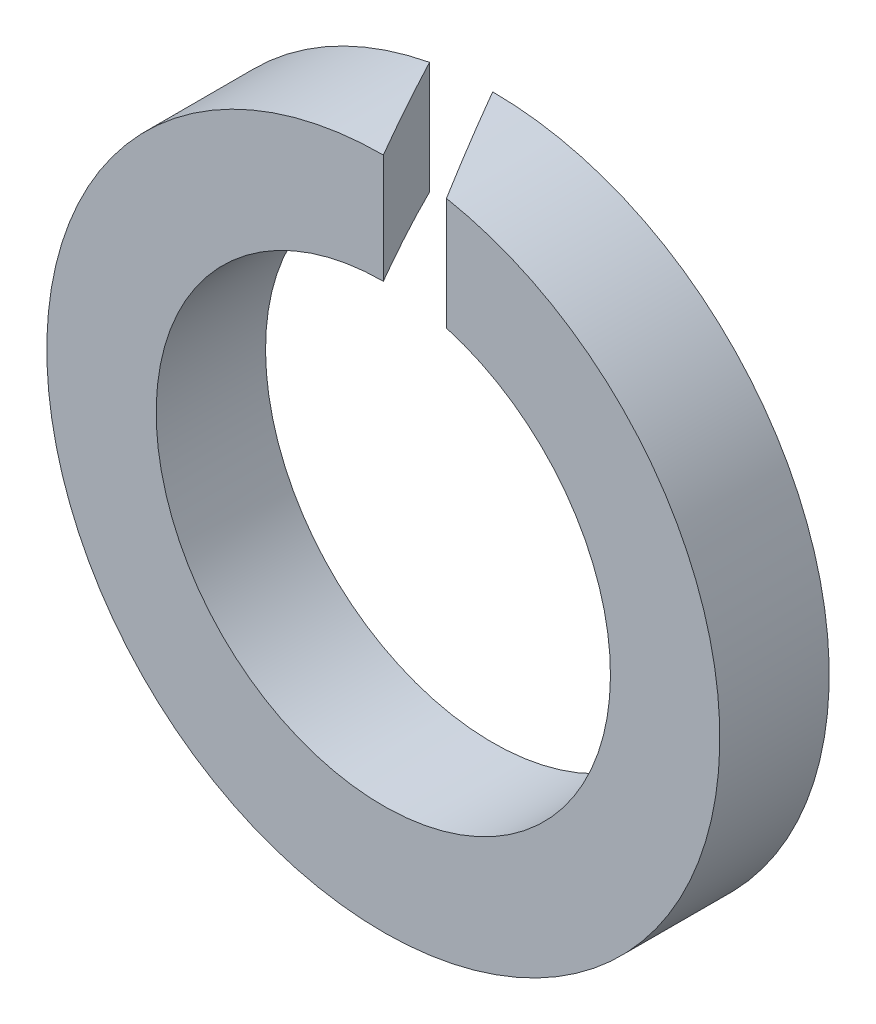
from build123d import *

# Parameters (mm, degrees)
SKETCH1_R          = 4
SKETCH1_R_2        = 2.7
BASE_EXTRUDE_DEPTH = 1.3
CUT_EXTRUDE1_DEPTH = 6.804308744


with BuildPart() as part:
    # Sketch1 → Base-Extrude (new body)
    with BuildSketch(Plane.XY):
        Circle(SKETCH1_R)
        Circle(SKETCH1_R_2, mode=Mode.SUBTRACT)
    extrude(amount=-BASE_EXTRUDE_DEPTH)

    # Sketch2 → Cut-Extrude1 (cut, through all)
    with BuildSketch(Plane(origin=(0, 0, 0), x_dir=(1, 0, 0), z_dir=(0, 1, 0))):
        Polygon((0, 1.3), (0.75055535, 0), (0, 0), (-0.75055535, 1.3), align=None)
    extrude(amount=CUT_EXTRUDE1_DEPTH, mode=Mode.SUBTRACT)


solid = part.part
